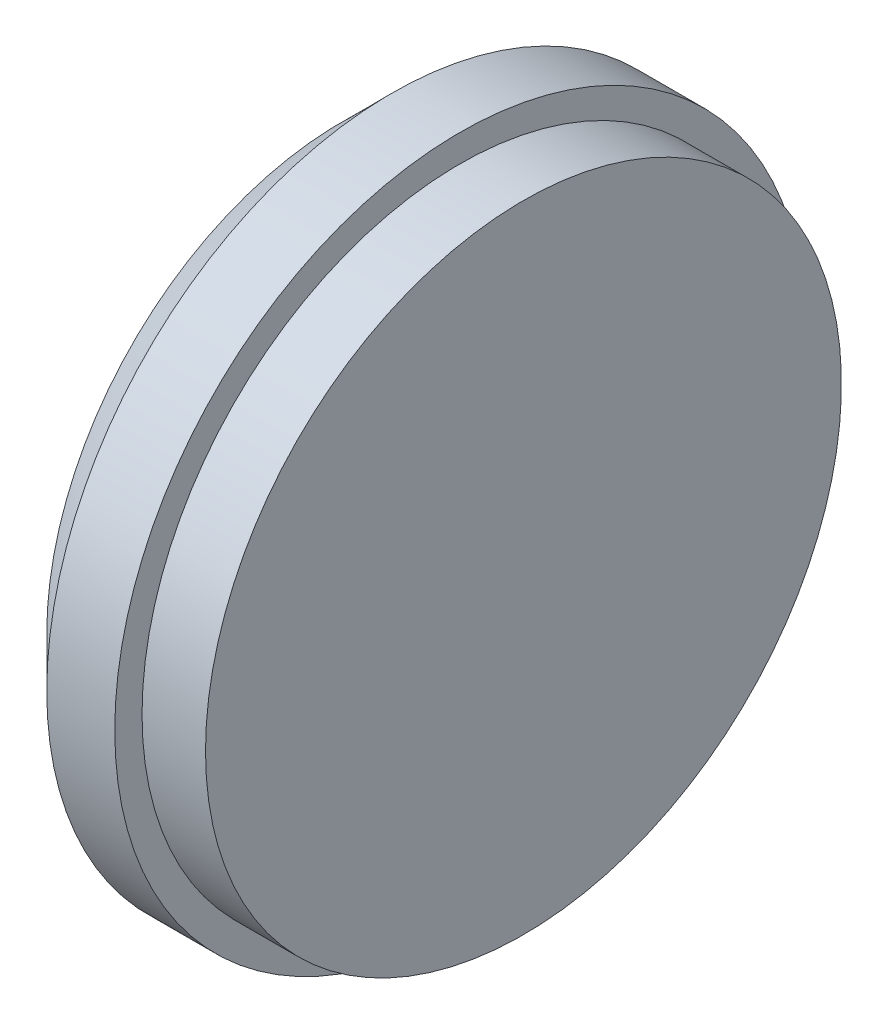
from build123d import *


with BuildPart() as part:
    # Sketch1 → Revolve1 (revolve)
    with BuildSketch(Plane.XY, mode=Mode.PRIVATE) as revolve1_sk:
        Polygon((-6.34746, 24.58466), (-6.34746, -3.25374), (-11.90498, -3.25374), (-11.90498, -5.64134), (-17.85874, -5.64134), (-22.22246, -1.27762), (-22.22246, 24.58466), align=None)
    revolve(revolve1_sk.sketch.rotate(Axis((-22.22246, 24.58466, 0), (1, 0, 0)), 270), axis=Axis((-22.22246, 24.58466, 0), (1, 0, 0)))


solid = part.part
